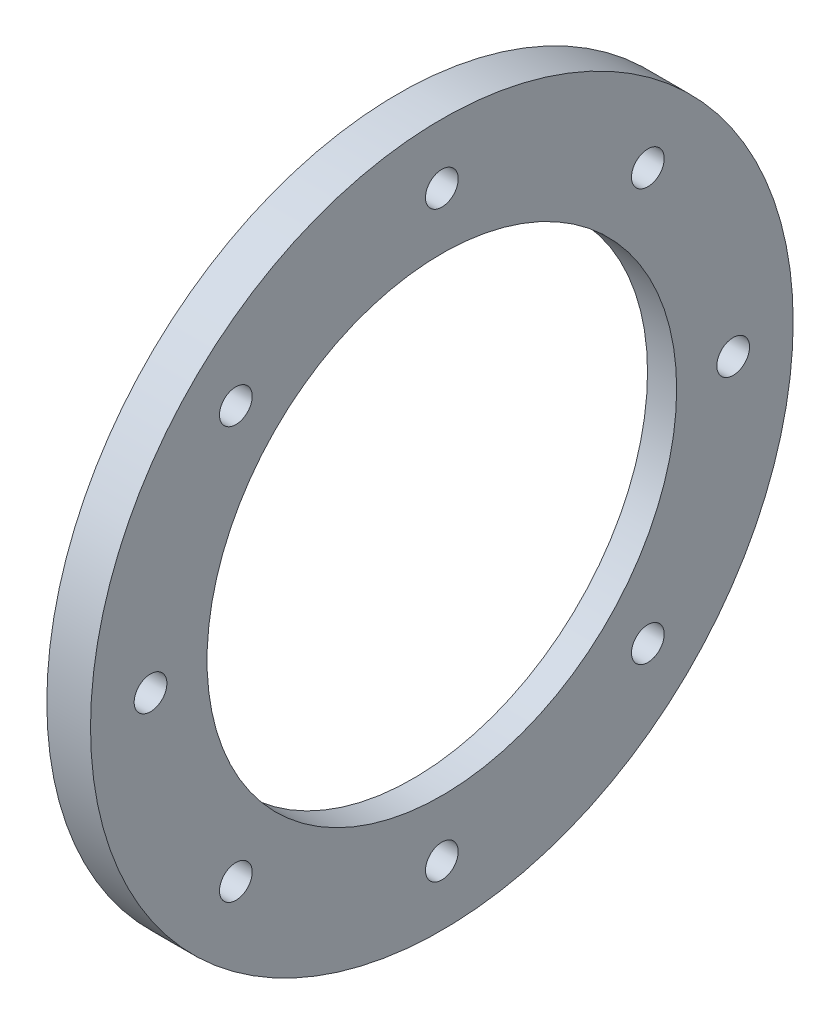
ISO-10303-21;
HEADER;
FILE_DESCRIPTION(('STEP AP214'),'2;1');
FILE_NAME('part.step','',(''),(''),'','','');
FILE_SCHEMA(('AUTOMOTIVE_DESIGN { 1 0 10303 214 1 1 1 1 }'));
ENDSEC;
DATA;
#1=APPLICATION_CONTEXT('core data for automotive mechanical design processes');
#2=APPLICATION_PROTOCOL_DEFINITION('international standard','automotive_design',2000,#1);
#3=PRODUCT_CONTEXT('',#1,'mechanical');
#4=PRODUCT('Part','Part','',(#3));
#5=PRODUCT_RELATED_PRODUCT_CATEGORY('part','',(#4));
#6=PRODUCT_DEFINITION_FORMATION('','',#4);
#7=PRODUCT_DEFINITION_CONTEXT('part definition',#1,'design');
#8=PRODUCT_DEFINITION('design','',#6,#7);
#9=PRODUCT_DEFINITION_SHAPE('','',#8);
#10=(LENGTH_UNIT() NAMED_UNIT(*) SI_UNIT(.MILLI.,.METRE.));
#11=(NAMED_UNIT(*) PLANE_ANGLE_UNIT() SI_UNIT($,.RADIAN.));
#12=(NAMED_UNIT(*) SI_UNIT($,.STERADIAN.) SOLID_ANGLE_UNIT());
#13=UNCERTAINTY_MEASURE_WITH_UNIT(LENGTH_MEASURE(1.E-05),#10,'distance_accuracy_value','');
#14=(GEOMETRIC_REPRESENTATION_CONTEXT(3) GLOBAL_UNCERTAINTY_ASSIGNED_CONTEXT((#13)) GLOBAL_UNIT_ASSIGNED_CONTEXT((#10,
#11,#12)) REPRESENTATION_CONTEXT('',''));
#15=CARTESIAN_POINT('',(0.,0.,0.));
#16=DIRECTION('',(0.,0.,1.));
#17=DIRECTION('',(1.,0.,0.));
#18=AXIS2_PLACEMENT_3D('',#15,#16,#17);
#19=CARTESIAN_POINT('',(-212.725,7.59442368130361,0.));
#20=DIRECTION('',(1.,0.,0.));
#21=DIRECTION('',(0.,0.,-1.));
#22=AXIS2_PLACEMENT_3D('',#19,#20,#21);
#23=PLANE('',#22);
#24=CARTESIAN_POINT('',(-212.725,63.5,0.));
#25=DIRECTION('',(-1.,0.,0.));
#26=DIRECTION('',(0.,0.,1.));
#27=AXIS2_PLACEMENT_3D('',#24,#25,#26);
#28=CIRCLE('',#27,3.56869999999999);
#29=CARTESIAN_POINT('',(-212.725,63.5,3.56869999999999));
#30=VERTEX_POINT('',#29);
#31=EDGE_CURVE('E96',#30,#30,#28,.T.);
#32=ORIENTED_EDGE('',*,*,#31,.T.);
#33=EDGE_LOOP('',(#32));
#34=FACE_BOUND('',#33,.T.);
#35=CARTESIAN_POINT('',(-212.725,44.901280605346,44.9012806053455));
#36=DIRECTION('',(-1.,0.,0.));
#37=DIRECTION('',(0.,0.,1.));
#38=AXIS2_PLACEMENT_3D('',#35,#36,#37);
#39=CIRCLE('',#38,3.5687);
#40=CARTESIAN_POINT('',(-212.725,44.901280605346,48.4699806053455));
#41=VERTEX_POINT('',#40);
#42=EDGE_CURVE('E90',#41,#41,#39,.T.);
#43=ORIENTED_EDGE('',*,*,#42,.T.);
#44=EDGE_LOOP('',(#43));
#45=FACE_BOUND('',#44,.T.);
#46=CARTESIAN_POINT('',(-212.725,6.01949046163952E-13,63.4999999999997));
#47=DIRECTION('',(-1.,0.,0.));
#48=DIRECTION('',(0.,0.,1.));
#49=AXIS2_PLACEMENT_3D('',#46,#47,#48);
#50=CIRCLE('',#49,3.5687);
#51=CARTESIAN_POINT('',(-212.725,6.01949046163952E-13,67.0686999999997));
#52=VERTEX_POINT('',#51);
#53=EDGE_CURVE('E84',#52,#52,#50,.T.);
#54=ORIENTED_EDGE('',*,*,#53,.T.);
#55=EDGE_LOOP('',(#54));
#56=FACE_BOUND('',#55,.T.);
#57=CARTESIAN_POINT('',(-212.725,0.,0.));
#58=DIRECTION('',(1.,0.,0.));
#59=DIRECTION('',(0.,0.,-1.));
#60=AXIS2_PLACEMENT_3D('',#57,#58,#59);
#61=CIRCLE('',#60,51.181);
#62=CARTESIAN_POINT('',(-212.725,0.,-51.181));
#63=VERTEX_POINT('',#62);
#64=EDGE_CURVE('E42',#63,#63,#61,.T.);
#65=ORIENTED_EDGE('',*,*,#64,.F.);
#66=EDGE_LOOP('',(#65));
#67=FACE_BOUND('',#66,.T.);
#68=CARTESIAN_POINT('',(-212.725,0.,0.));
#69=DIRECTION('',(1.,0.,0.));
#70=DIRECTION('',(0.,0.,-1.));
#71=AXIS2_PLACEMENT_3D('',#68,#69,#70);
#72=CIRCLE('',#71,76.581);
#73=CARTESIAN_POINT('',(-212.725,0.,-76.581));
#74=VERTEX_POINT('',#73);
#75=EDGE_CURVE('E38',#74,#74,#72,.T.);
#76=ORIENTED_EDGE('',*,*,#75,.T.);
#77=EDGE_LOOP('',(#76));
#78=FACE_BOUND('',#77,.T.);
#79=CARTESIAN_POINT('',(-212.725,44.9012806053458,-44.9012806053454));
#80=DIRECTION('',(-1.,0.,0.));
#81=DIRECTION('',(0.,0.,1.));
#82=AXIS2_PLACEMENT_3D('',#79,#80,#81);
#83=CIRCLE('',#82,3.5687);
#84=CARTESIAN_POINT('',(-212.725,44.9012806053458,-41.3325806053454));
#85=VERTEX_POINT('',#84);
#86=EDGE_CURVE('E54',#85,#85,#83,.T.);
#87=ORIENTED_EDGE('',*,*,#86,.T.);
#88=EDGE_LOOP('',(#87));
#89=FACE_BOUND('',#88,.T.);
#90=CARTESIAN_POINT('',(-212.725,2.45463371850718E-13,-63.4999999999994));
#91=DIRECTION('',(-1.,0.,0.));
#92=DIRECTION('',(0.,0.,1.));
#93=AXIS2_PLACEMENT_3D('',#90,#91,#92);
#94=CIRCLE('',#93,3.5687);
#95=CARTESIAN_POINT('',(-212.725,2.45463371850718E-13,-59.9312999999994));
#96=VERTEX_POINT('',#95);
#97=EDGE_CURVE('E60',#96,#96,#94,.T.);
#98=ORIENTED_EDGE('',*,*,#97,.T.);
#99=EDGE_LOOP('',(#98));
#100=FACE_BOUND('',#99,.T.);
#101=CARTESIAN_POINT('',(-212.725,-44.9012806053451,-44.9012806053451));
#102=DIRECTION('',(-1.,0.,0.));
#103=DIRECTION('',(0.,0.,1.));
#104=AXIS2_PLACEMENT_3D('',#101,#102,#103);
#105=CIRCLE('',#104,3.5687);
#106=CARTESIAN_POINT('',(-212.725,-44.9012806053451,-41.3325806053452));
#107=VERTEX_POINT('',#106);
#108=EDGE_CURVE('E66',#107,#107,#105,.T.);
#109=ORIENTED_EDGE('',*,*,#108,.T.);
#110=EDGE_LOOP('',(#109));
#111=FACE_BOUND('',#110,.T.);
#112=CARTESIAN_POINT('',(-212.725,-63.4999999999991,3.57353036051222E-13));
#113=DIRECTION('',(-1.,0.,0.));
#114=DIRECTION('',(0.,0.,1.));
#115=AXIS2_PLACEMENT_3D('',#112,#113,#114);
#116=CIRCLE('',#115,3.5687);
#117=CARTESIAN_POINT('',(-212.725,-63.4999999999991,3.56870000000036));
#118=VERTEX_POINT('',#117);
#119=EDGE_CURVE('E72',#118,#118,#116,.T.);
#120=ORIENTED_EDGE('',*,*,#119,.T.);
#121=EDGE_LOOP('',(#120));
#122=FACE_BOUND('',#121,.T.);
#123=CARTESIAN_POINT('',(-212.725,-44.9012806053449,44.9012806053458));
#124=DIRECTION('',(-1.,0.,0.));
#125=DIRECTION('',(0.,0.,1.));
#126=AXIS2_PLACEMENT_3D('',#123,#124,#125);
#127=CIRCLE('',#126,3.5687);
#128=CARTESIAN_POINT('',(-212.725,-44.9012806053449,48.4699806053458));
#129=VERTEX_POINT('',#128);
#130=EDGE_CURVE('E78',#129,#129,#127,.T.);
#131=ORIENTED_EDGE('',*,*,#130,.T.);
#132=EDGE_LOOP('',(#131));
#133=FACE_BOUND('',#132,.T.);
#134=ADVANCED_FACE('F31',(#34,#45,#56,#67,#78,#89,#100,#111,#122,#133),#23,.T.);
#135=CARTESIAN_POINT('',(-222.25,7.59442368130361,0.));
#136=DIRECTION('',(1.,0.,0.));
#137=DIRECTION('',(0.,0.,-1.));
#138=AXIS2_PLACEMENT_3D('',#135,#136,#137);
#139=PLANE('',#138);
#140=CARTESIAN_POINT('',(-222.25,63.5,0.));
#141=DIRECTION('',(-1.,0.,0.));
#142=DIRECTION('',(0.,0.,1.));
#143=AXIS2_PLACEMENT_3D('',#140,#141,#142);
#144=CIRCLE('',#143,3.56869999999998);
#145=CARTESIAN_POINT('',(-222.25,63.5,3.56869999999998));
#146=VERTEX_POINT('',#145);
#147=EDGE_CURVE('E99',#146,#146,#144,.T.);
#148=ORIENTED_EDGE('',*,*,#147,.F.);
#149=EDGE_LOOP('',(#148));
#150=FACE_BOUND('',#149,.T.);
#151=CARTESIAN_POINT('',(-222.25,44.901280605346,44.9012806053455));
#152=DIRECTION('',(-1.,0.,0.));
#153=DIRECTION('',(0.,0.,1.));
#154=AXIS2_PLACEMENT_3D('',#151,#152,#153);
#155=CIRCLE('',#154,3.56869999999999);
#156=CARTESIAN_POINT('',(-222.25,44.901280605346,48.4699806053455));
#157=VERTEX_POINT('',#156);
#158=EDGE_CURVE('E93',#157,#157,#155,.T.);
#159=ORIENTED_EDGE('',*,*,#158,.F.);
#160=EDGE_LOOP('',(#159));
#161=FACE_BOUND('',#160,.T.);
#162=CARTESIAN_POINT('',(-222.25,6.01949046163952E-13,63.4999999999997));
#163=DIRECTION('',(-1.,0.,0.));
#164=DIRECTION('',(0.,0.,1.));
#165=AXIS2_PLACEMENT_3D('',#162,#163,#164);
#166=CIRCLE('',#165,3.56869999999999);
#167=CARTESIAN_POINT('',(-222.25,6.01949046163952E-13,67.0686999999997));
#168=VERTEX_POINT('',#167);
#169=EDGE_CURVE('E87',#168,#168,#166,.T.);
#170=ORIENTED_EDGE('',*,*,#169,.F.);
#171=EDGE_LOOP('',(#170));
#172=FACE_BOUND('',#171,.T.);
#173=CARTESIAN_POINT('',(-222.25,-44.9012806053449,44.9012806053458));
#174=DIRECTION('',(-1.,0.,0.));
#175=DIRECTION('',(0.,0.,1.));
#176=AXIS2_PLACEMENT_3D('',#173,#174,#175);
#177=CIRCLE('',#176,3.56869999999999);
#178=CARTESIAN_POINT('',(-222.25,-44.9012806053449,48.4699806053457));
#179=VERTEX_POINT('',#178);
#180=EDGE_CURVE('E81',#179,#179,#177,.T.);
#181=ORIENTED_EDGE('',*,*,#180,.F.);
#182=EDGE_LOOP('',(#181));
#183=FACE_BOUND('',#182,.T.);
#184=CARTESIAN_POINT('',(-222.25,-63.4999999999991,3.57353036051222E-13));
#185=DIRECTION('',(-1.,0.,0.));
#186=DIRECTION('',(0.,0.,1.));
#187=AXIS2_PLACEMENT_3D('',#184,#185,#186);
#188=CIRCLE('',#187,3.56869999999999);
#189=CARTESIAN_POINT('',(-222.25,-63.4999999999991,3.56870000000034));
#190=VERTEX_POINT('',#189);
#191=EDGE_CURVE('E75',#190,#190,#188,.T.);
#192=ORIENTED_EDGE('',*,*,#191,.F.);
#193=EDGE_LOOP('',(#192));
#194=FACE_BOUND('',#193,.T.);
#195=CARTESIAN_POINT('',(-222.25,-44.9012806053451,-44.9012806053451));
#196=DIRECTION('',(-1.,0.,0.));
#197=DIRECTION('',(0.,0.,1.));
#198=AXIS2_PLACEMENT_3D('',#195,#196,#197);
#199=CIRCLE('',#198,3.56869999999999);
#200=CARTESIAN_POINT('',(-222.25,-44.9012806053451,-41.3325806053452));
#201=VERTEX_POINT('',#200);
#202=EDGE_CURVE('E69',#201,#201,#199,.T.);
#203=ORIENTED_EDGE('',*,*,#202,.F.);
#204=EDGE_LOOP('',(#203));
#205=FACE_BOUND('',#204,.T.);
#206=CARTESIAN_POINT('',(-222.25,2.45463371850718E-13,-63.4999999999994));
#207=DIRECTION('',(-1.,0.,0.));
#208=DIRECTION('',(0.,0.,1.));
#209=AXIS2_PLACEMENT_3D('',#206,#207,#208);
#210=CIRCLE('',#209,3.56869999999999);
#211=CARTESIAN_POINT('',(-222.25,2.45463371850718E-13,-59.9312999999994));
#212=VERTEX_POINT('',#211);
#213=EDGE_CURVE('E63',#212,#212,#210,.T.);
#214=ORIENTED_EDGE('',*,*,#213,.F.);
#215=EDGE_LOOP('',(#214));
#216=FACE_BOUND('',#215,.T.);
#217=CARTESIAN_POINT('',(-222.25,44.9012806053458,-44.9012806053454));
#218=DIRECTION('',(-1.,0.,0.));
#219=DIRECTION('',(0.,0.,1.));
#220=AXIS2_PLACEMENT_3D('',#217,#218,#219);
#221=CIRCLE('',#220,3.56869999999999);
#222=CARTESIAN_POINT('',(-222.25,44.9012806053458,-41.3325806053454));
#223=VERTEX_POINT('',#222);
#224=EDGE_CURVE('E57',#223,#223,#221,.T.);
#225=ORIENTED_EDGE('',*,*,#224,.F.);
#226=EDGE_LOOP('',(#225));
#227=FACE_BOUND('',#226,.T.);
#228=CARTESIAN_POINT('',(-222.25,0.,0.));
#229=DIRECTION('',(1.,0.,0.));
#230=DIRECTION('',(0.,0.,-1.));
#231=AXIS2_PLACEMENT_3D('',#228,#229,#230);
#232=CIRCLE('',#231,76.581);
#233=CARTESIAN_POINT('',(-222.25,0.,-76.581));
#234=VERTEX_POINT('',#233);
#235=EDGE_CURVE('E10',#234,#234,#232,.T.);
#236=ORIENTED_EDGE('',*,*,#235,.F.);
#237=EDGE_LOOP('',(#236));
#238=FACE_BOUND('',#237,.T.);
#239=CARTESIAN_POINT('',(-222.25,0.,0.));
#240=DIRECTION('',(1.,0.,0.));
#241=DIRECTION('',(0.,0.,-1.));
#242=AXIS2_PLACEMENT_3D('',#239,#240,#241);
#243=CIRCLE('',#242,59.9042408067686);
#244=CARTESIAN_POINT('',(-222.25,0.,-59.9042408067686));
#245=VERTEX_POINT('',#244);
#246=EDGE_CURVE('E51',#245,#245,#243,.T.);
#247=ORIENTED_EDGE('',*,*,#246,.T.);
#248=EDGE_LOOP('',(#247));
#249=FACE_BOUND('',#248,.T.);
#250=ADVANCED_FACE('F33',(#150,#161,#172,#183,#194,#205,#216,#227,#238,#249),#139,.F.);
#251=CARTESIAN_POINT('',(0.,0.,0.));
#252=DIRECTION('',(1.,0.,0.));
#253=DIRECTION('',(0.,0.,-1.));
#254=AXIS2_PLACEMENT_3D('',#251,#252,#253);
#255=CYLINDRICAL_SURFACE('',#254,76.581);
#256=ORIENTED_EDGE('',*,*,#235,.T.);
#257=EDGE_LOOP('',(#256));
#258=FACE_BOUND('',#257,.T.);
#259=ORIENTED_EDGE('',*,*,#75,.F.);
#260=EDGE_LOOP('',(#259));
#261=FACE_BOUND('',#260,.T.);
#262=ADVANCED_FACE('F107',(#258,#261),#255,.T.);
#263=CARTESIAN_POINT('',(0.,0.,0.));
#264=DIRECTION('',(1.,0.,0.));
#265=DIRECTION('',(0.,0.,-1.));
#266=AXIS2_PLACEMENT_3D('',#263,#264,#265);
#267=CYLINDRICAL_SURFACE('',#266,51.181);
#268=CARTESIAN_POINT('',(-219.075,0.,0.));
#269=DIRECTION('',(1.,0.,0.));
#270=DIRECTION('',(0.,0.,-1.));
#271=AXIS2_PLACEMENT_3D('',#268,#269,#270);
#272=CIRCLE('',#271,51.181);
#273=CARTESIAN_POINT('',(-219.075,0.,-51.181));
#274=VERTEX_POINT('',#273);
#275=EDGE_CURVE('E46',#274,#274,#272,.T.);
#276=ORIENTED_EDGE('',*,*,#275,.F.);
#277=EDGE_LOOP('',(#276));
#278=FACE_BOUND('',#277,.T.);
#279=ORIENTED_EDGE('',*,*,#64,.T.);
#280=EDGE_LOOP('',(#279));
#281=FACE_BOUND('',#280,.T.);
#282=ADVANCED_FACE('F128',(#278,#281),#267,.F.);
#283=CARTESIAN_POINT('',(-222.25,0.,0.));
#284=DIRECTION('',(-1.,0.,0.));
#285=DIRECTION('',(0.,0.,1.));
#286=AXIS2_PLACEMENT_3D('',#283,#284,#285);
#287=CONICAL_SURFACE('',#286,59.9042408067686,1.22173047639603);
#288=ORIENTED_EDGE('',*,*,#275,.T.);
#289=EDGE_LOOP('',(#288));
#290=FACE_BOUND('',#289,.T.);
#291=ORIENTED_EDGE('',*,*,#246,.F.);
#292=EDGE_LOOP('',(#291));
#293=FACE_BOUND('',#292,.T.);
#294=ADVANCED_FACE('F125',(#290,#293),#287,.F.);
#295=CARTESIAN_POINT('',(-222.25,44.9012806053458,-44.9012806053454));
#296=DIRECTION('',(-1.,0.,0.));
#297=DIRECTION('',(0.,0.,1.));
#298=AXIS2_PLACEMENT_3D('',#295,#296,#297);
#299=CYLINDRICAL_SURFACE('',#298,3.56869999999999);
#300=ORIENTED_EDGE('',*,*,#86,.F.);
#301=EDGE_LOOP('',(#300));
#302=FACE_BOUND('',#301,.T.);
#303=ORIENTED_EDGE('',*,*,#224,.T.);
#304=EDGE_LOOP('',(#303));
#305=FACE_BOUND('',#304,.T.);
#306=ADVANCED_FACE('F127',(#302,#305),#299,.F.);
#307=CARTESIAN_POINT('',(-222.25,2.45463371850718E-13,-63.4999999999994));
#308=DIRECTION('',(-1.,0.,0.));
#309=DIRECTION('',(0.,0.,1.));
#310=AXIS2_PLACEMENT_3D('',#307,#308,#309);
#311=CYLINDRICAL_SURFACE('',#310,3.56869999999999);
#312=ORIENTED_EDGE('',*,*,#97,.F.);
#313=EDGE_LOOP('',(#312));
#314=FACE_BOUND('',#313,.T.);
#315=ORIENTED_EDGE('',*,*,#213,.T.);
#316=EDGE_LOOP('',(#315));
#317=FACE_BOUND('',#316,.T.);
#318=ADVANCED_FACE('F135',(#314,#317),#311,.F.);
#319=CARTESIAN_POINT('',(-222.25,-44.9012806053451,-44.9012806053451));
#320=DIRECTION('',(-1.,0.,0.));
#321=DIRECTION('',(0.,0.,1.));
#322=AXIS2_PLACEMENT_3D('',#319,#320,#321);
#323=CYLINDRICAL_SURFACE('',#322,3.56869999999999);
#324=ORIENTED_EDGE('',*,*,#108,.F.);
#325=EDGE_LOOP('',(#324));
#326=FACE_BOUND('',#325,.T.);
#327=ORIENTED_EDGE('',*,*,#202,.T.);
#328=EDGE_LOOP('',(#327));
#329=FACE_BOUND('',#328,.T.);
#330=ADVANCED_FACE('F184',(#326,#329),#323,.F.);
#331=CARTESIAN_POINT('',(-222.25,-63.4999999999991,3.57353036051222E-13));
#332=DIRECTION('',(-1.,0.,0.));
#333=DIRECTION('',(0.,0.,1.));
#334=AXIS2_PLACEMENT_3D('',#331,#332,#333);
#335=CYLINDRICAL_SURFACE('',#334,3.56869999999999);
#336=ORIENTED_EDGE('',*,*,#119,.F.);
#337=EDGE_LOOP('',(#336));
#338=FACE_BOUND('',#337,.T.);
#339=ORIENTED_EDGE('',*,*,#191,.T.);
#340=EDGE_LOOP('',(#339));
#341=FACE_BOUND('',#340,.T.);
#342=ADVANCED_FACE('F194',(#338,#341),#335,.F.);
#343=CARTESIAN_POINT('',(-222.25,-44.9012806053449,44.9012806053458));
#344=DIRECTION('',(-1.,0.,0.));
#345=DIRECTION('',(0.,0.,1.));
#346=AXIS2_PLACEMENT_3D('',#343,#344,#345);
#347=CYLINDRICAL_SURFACE('',#346,3.56869999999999);
#348=ORIENTED_EDGE('',*,*,#130,.F.);
#349=EDGE_LOOP('',(#348));
#350=FACE_BOUND('',#349,.T.);
#351=ORIENTED_EDGE('',*,*,#180,.T.);
#352=EDGE_LOOP('',(#351));
#353=FACE_BOUND('',#352,.T.);
#354=ADVANCED_FACE('F204',(#350,#353),#347,.F.);
#355=CARTESIAN_POINT('',(-222.25,6.01949046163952E-13,63.4999999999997));
#356=DIRECTION('',(-1.,0.,0.));
#357=DIRECTION('',(0.,0.,1.));
#358=AXIS2_PLACEMENT_3D('',#355,#356,#357);
#359=CYLINDRICAL_SURFACE('',#358,3.56869999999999);
#360=ORIENTED_EDGE('',*,*,#53,.F.);
#361=EDGE_LOOP('',(#360));
#362=FACE_BOUND('',#361,.T.);
#363=ORIENTED_EDGE('',*,*,#169,.T.);
#364=EDGE_LOOP('',(#363));
#365=FACE_BOUND('',#364,.T.);
#366=ADVANCED_FACE('F214',(#362,#365),#359,.F.);
#367=CARTESIAN_POINT('',(-222.25,44.901280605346,44.9012806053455));
#368=DIRECTION('',(-1.,0.,0.));
#369=DIRECTION('',(0.,0.,1.));
#370=AXIS2_PLACEMENT_3D('',#367,#368,#369);
#371=CYLINDRICAL_SURFACE('',#370,3.56869999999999);
#372=ORIENTED_EDGE('',*,*,#42,.F.);
#373=EDGE_LOOP('',(#372));
#374=FACE_BOUND('',#373,.T.);
#375=ORIENTED_EDGE('',*,*,#158,.T.);
#376=EDGE_LOOP('',(#375));
#377=FACE_BOUND('',#376,.T.);
#378=ADVANCED_FACE('F224',(#374,#377),#371,.F.);
#379=CARTESIAN_POINT('',(-222.25,63.5,0.));
#380=DIRECTION('',(-1.,0.,0.));
#381=DIRECTION('',(0.,0.,1.));
#382=AXIS2_PLACEMENT_3D('',#379,#380,#381);
#383=CYLINDRICAL_SURFACE('',#382,3.56869999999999);
#384=ORIENTED_EDGE('',*,*,#31,.F.);
#385=EDGE_LOOP('',(#384));
#386=FACE_BOUND('',#385,.T.);
#387=ORIENTED_EDGE('',*,*,#147,.T.);
#388=EDGE_LOOP('',(#387));
#389=FACE_BOUND('',#388,.T.);
#390=ADVANCED_FACE('F103',(#386,#389),#383,.F.);
#391=CLOSED_SHELL('',(#134,#250,#262,#282,#294,#306,#318,#330,#342,#354,#366,#378,#390));
#392=MANIFOLD_SOLID_BREP('B2',#391);
#393=ADVANCED_BREP_SHAPE_REPRESENTATION('',(#18,#392),#14);
#394=SHAPE_DEFINITION_REPRESENTATION(#9,#393);
ENDSEC;
END-ISO-10303-21;
